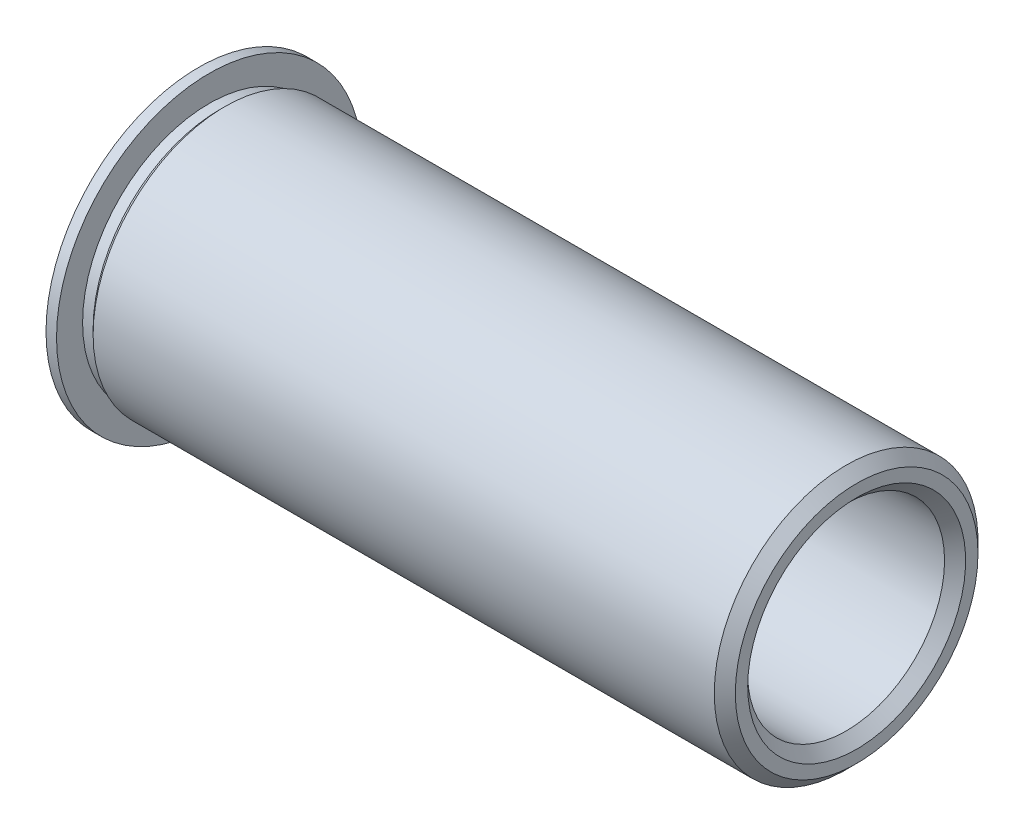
from build123d import *

# Parameters (mm, degrees)
SKETCH3_R          = 2.3749
CUT_EXTRUDE1_DEPTH = 101.453803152
CHAMFER2_SIZE      = 0.254
CHAMFER3_SIZE      = 0.254


with BuildPart() as part:
    # Sketch2 → Revolve3 (revolve)
    with BuildSketch(Plane.XY, mode=Mode.PRIVATE) as revolve3_sk:
        Polygon((-60.966082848, 95.440087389), (-60.966082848, 99.123087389), (-60.712082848, 99.123087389), (-60.712082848, 98.494437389), (-60.458082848, 98.494437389), (-60.331082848, 98.621437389), (-45.345082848, 98.621437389), (-45.091082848, 98.367437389), (-45.091082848, 95.440087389), align=None)
    revolve(revolve3_sk.sketch.rotate(Axis((-60.966082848, 95.440087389, 0), (1, 0, 0)), 90), axis=Axis((-60.966082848, 95.440087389, 0), (1, 0, 0)))

    # Sketch3 → Cut-Extrude1 (cut, through all)
    with BuildSketch(Plane(origin=(-45.091082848, 0, 0), x_dir=(0, 0, -1), z_dir=(1, 0, 0))):
        with Locations((0, 95.440087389)):
            Circle(SKETCH3_R)
    extrude(amount=-CUT_EXTRUDE1_DEPTH, mode=Mode.SUBTRACT)

    # Chamfer2
    chamfer2_edges = [part.edges().sort_by_distance(p)[0] for p in [
        (-60.966082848, 95.440087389, 2.3749),
    ]]
    chamfer(chamfer2_edges, length=CHAMFER2_SIZE)

    # Chamfer3
    chamfer3_edges = [part.edges().sort_by_distance(p)[0] for p in [
        (-45.091082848, 95.440087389, 2.3749),
    ]]
    chamfer(chamfer3_edges, length=CHAMFER3_SIZE)


solid = part.part
